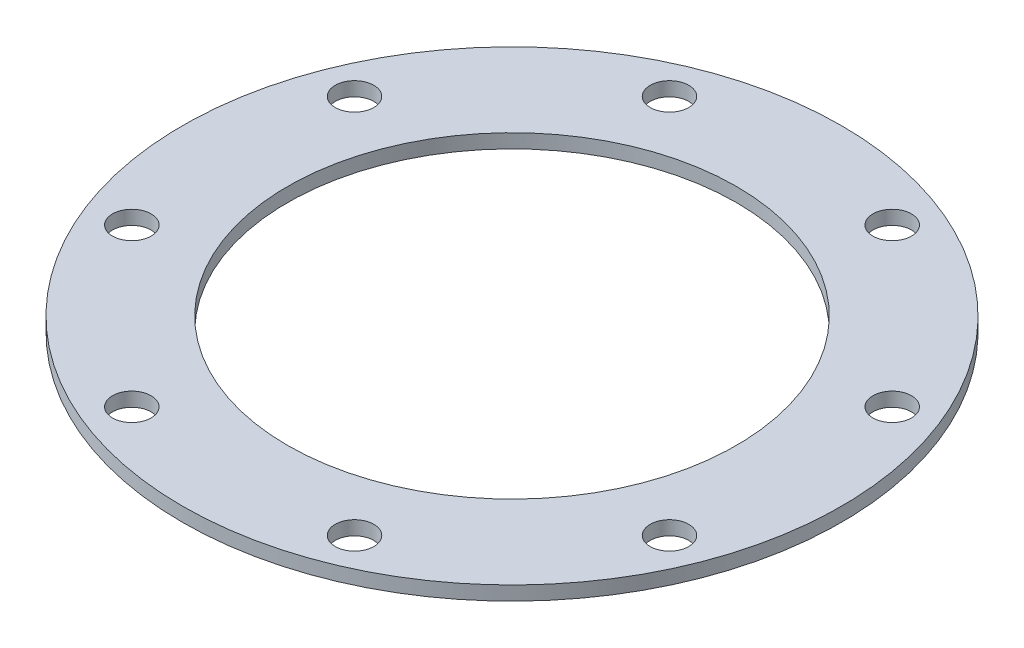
ISO-10303-21;
HEADER;
FILE_DESCRIPTION(('STEP AP214'),'2;1');
FILE_NAME('part.step','',(''),(''),'','','');
FILE_SCHEMA(('AUTOMOTIVE_DESIGN { 1 0 10303 214 1 1 1 1 }'));
ENDSEC;
DATA;
#1=APPLICATION_CONTEXT('core data for automotive mechanical design processes');
#2=APPLICATION_PROTOCOL_DEFINITION('international standard','automotive_design',2000,#1);
#3=PRODUCT_CONTEXT('',#1,'mechanical');
#4=PRODUCT('Part','Part','',(#3));
#5=PRODUCT_RELATED_PRODUCT_CATEGORY('part','',(#4));
#6=PRODUCT_DEFINITION_FORMATION('','',#4);
#7=PRODUCT_DEFINITION_CONTEXT('part definition',#1,'design');
#8=PRODUCT_DEFINITION('design','',#6,#7);
#9=PRODUCT_DEFINITION_SHAPE('','',#8);
#10=(LENGTH_UNIT() NAMED_UNIT(*) SI_UNIT(.MILLI.,.METRE.));
#11=(NAMED_UNIT(*) PLANE_ANGLE_UNIT() SI_UNIT($,.RADIAN.));
#12=(NAMED_UNIT(*) SI_UNIT($,.STERADIAN.) SOLID_ANGLE_UNIT());
#13=UNCERTAINTY_MEASURE_WITH_UNIT(LENGTH_MEASURE(1.E-05),#10,'distance_accuracy_value','');
#14=(GEOMETRIC_REPRESENTATION_CONTEXT(3) GLOBAL_UNCERTAINTY_ASSIGNED_CONTEXT((#13)) GLOBAL_UNIT_ASSIGNED_CONTEXT((#10,
#11,#12)) REPRESENTATION_CONTEXT('',''));
#15=CARTESIAN_POINT('',(0.,0.,0.));
#16=DIRECTION('',(0.,0.,1.));
#17=DIRECTION('',(1.,0.,0.));
#18=AXIS2_PLACEMENT_3D('',#15,#16,#17);
#19=CARTESIAN_POINT('',(0.,6.35,0.));
#20=DIRECTION('',(0.,1.,0.));
#21=DIRECTION('',(0.,0.,1.));
#22=AXIS2_PLACEMENT_3D('',#19,#20,#21);
#23=PLANE('',#22);
#24=CARTESIAN_POINT('',(-50.4233257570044,6.35,-121.732676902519));
#25=DIRECTION('',(0.,1.,0.));
#26=DIRECTION('',(0.707106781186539,0.,0.707106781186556));
#27=AXIS2_PLACEMENT_3D('',#24,#25,#26);
#28=CIRCLE('',#27,8.73124999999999);
#29=CARTESIAN_POINT('',(-44.2493996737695,6.35,-115.558750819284));
#30=VERTEX_POINT('',#29);
#31=EDGE_CURVE('E128',#30,#30,#28,.T.);
#32=ORIENTED_EDGE('',*,*,#31,.F.);
#33=EDGE_LOOP('',(#32));
#34=FACE_BOUND('',#33,.T.);
#35=CARTESIAN_POINT('',(-121.732676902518,6.35,-50.4233257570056));
#36=DIRECTION('',(0.,1.,0.));
#37=DIRECTION('',(1.,0.,0.));
#38=AXIS2_PLACEMENT_3D('',#35,#36,#37);
#39=CIRCLE('',#38,8.73124999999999);
#40=CARTESIAN_POINT('',(-113.001426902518,6.35,-50.4233257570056));
#41=VERTEX_POINT('',#40);
#42=EDGE_CURVE('E130',#41,#41,#39,.T.);
#43=ORIENTED_EDGE('',*,*,#42,.F.);
#44=EDGE_LOOP('',(#43));
#45=FACE_BOUND('',#44,.T.);
#46=CARTESIAN_POINT('',(-121.732676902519,6.35,50.4233257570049));
#47=DIRECTION('',(0.,1.,0.));
#48=DIRECTION('',(0.707106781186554,0.,-0.707106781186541));
#49=AXIS2_PLACEMENT_3D('',#46,#47,#48);
#50=CIRCLE('',#49,8.73124999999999);
#51=CARTESIAN_POINT('',(-115.558750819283,6.35,44.2493996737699));
#52=VERTEX_POINT('',#51);
#53=EDGE_CURVE('E147',#52,#52,#50,.T.);
#54=ORIENTED_EDGE('',*,*,#53,.F.);
#55=EDGE_LOOP('',(#54));
#56=FACE_BOUND('',#55,.T.);
#57=CARTESIAN_POINT('',(-50.4233257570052,6.35,121.732676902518));
#58=DIRECTION('',(0.,1.,0.));
#59=DIRECTION('',(0.,0.,-1.));
#60=AXIS2_PLACEMENT_3D('',#57,#58,#59);
#61=CIRCLE('',#60,8.73124999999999);
#62=CARTESIAN_POINT('',(-50.4233257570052,6.35,113.001426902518));
#63=VERTEX_POINT('',#62);
#64=EDGE_CURVE('E146',#63,#63,#61,.T.);
#65=ORIENTED_EDGE('',*,*,#64,.F.);
#66=EDGE_LOOP('',(#65));
#67=FACE_BOUND('',#66,.T.);
#68=CARTESIAN_POINT('',(50.4233257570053,6.35,121.732676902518));
#69=DIRECTION('',(0.,1.,0.));
#70=DIRECTION('',(-0.707106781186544,0.,-0.707106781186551));
#71=AXIS2_PLACEMENT_3D('',#68,#69,#70);
#72=CIRCLE('',#71,8.73124999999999);
#73=CARTESIAN_POINT('',(44.2493996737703,6.35,115.558750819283));
#74=VERTEX_POINT('',#73);
#75=EDGE_CURVE('E154',#74,#74,#72,.T.);
#76=ORIENTED_EDGE('',*,*,#75,.F.);
#77=EDGE_LOOP('',(#76));
#78=FACE_BOUND('',#77,.T.);
#79=CARTESIAN_POINT('',(121.732676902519,6.35,50.4233257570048));
#80=DIRECTION('',(0.,1.,0.));
#81=DIRECTION('',(-1.,0.,0.));
#82=AXIS2_PLACEMENT_3D('',#79,#80,#81);
#83=CIRCLE('',#82,8.73124999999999);
#84=CARTESIAN_POINT('',(113.001426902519,6.35,50.4233257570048));
#85=VERTEX_POINT('',#84);
#86=EDGE_CURVE('E168',#85,#85,#83,.T.);
#87=ORIENTED_EDGE('',*,*,#86,.F.);
#88=EDGE_LOOP('',(#87));
#89=FACE_BOUND('',#88,.T.);
#90=CARTESIAN_POINT('',(121.732676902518,6.35,-50.4233257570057));
#91=DIRECTION('',(0.,1.,0.));
#92=DIRECTION('',(-0.707106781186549,0.,0.707106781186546));
#93=AXIS2_PLACEMENT_3D('',#90,#91,#92);
#94=CIRCLE('',#93,8.73124999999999);
#95=CARTESIAN_POINT('',(115.558750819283,6.35,-44.2493996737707));
#96=VERTEX_POINT('',#95);
#97=EDGE_CURVE('E167',#96,#96,#94,.T.);
#98=ORIENTED_EDGE('',*,*,#97,.F.);
#99=EDGE_LOOP('',(#98));
#100=FACE_BOUND('',#99,.T.);
#101=CARTESIAN_POINT('',(50.4233257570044,6.35,-121.732676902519));
#102=DIRECTION('',(0.,1.,0.));
#103=DIRECTION('',(0.,0.,1.));
#104=AXIS2_PLACEMENT_3D('',#101,#102,#103);
#105=CIRCLE('',#104,8.73124999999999);
#106=CARTESIAN_POINT('',(50.4233257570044,6.35,-113.001426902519));
#107=VERTEX_POINT('',#106);
#108=EDGE_CURVE('E55',#107,#107,#105,.T.);
#109=ORIENTED_EDGE('',*,*,#108,.F.);
#110=EDGE_LOOP('',(#109));
#111=FACE_BOUND('',#110,.T.);
#112=CARTESIAN_POINT('',(0.,6.35,0.));
#113=DIRECTION('',(0.,1.,0.));
#114=DIRECTION('',(0.,0.,1.));
#115=AXIS2_PLACEMENT_3D('',#112,#113,#114);
#116=CIRCLE('',#115,149.225);
#117=CARTESIAN_POINT('',(0.,6.35,149.225));
#118=VERTEX_POINT('',#117);
#119=EDGE_CURVE('E11',#118,#118,#116,.T.);
#120=ORIENTED_EDGE('',*,*,#119,.T.);
#121=EDGE_LOOP('',(#120));
#122=FACE_BOUND('',#121,.T.);
#123=CARTESIAN_POINT('',(0.,6.35,0.));
#124=DIRECTION('',(0.,1.,0.));
#125=DIRECTION('',(0.,0.,1.));
#126=AXIS2_PLACEMENT_3D('',#123,#124,#125);
#127=CIRCLE('',#126,101.6);
#128=CARTESIAN_POINT('',(0.,6.35,101.6));
#129=VERTEX_POINT('',#128);
#130=EDGE_CURVE('E46',#129,#129,#127,.T.);
#131=ORIENTED_EDGE('',*,*,#130,.F.);
#132=EDGE_LOOP('',(#131));
#133=FACE_BOUND('',#132,.T.);
#134=ADVANCED_FACE('F35',(#34,#45,#56,#67,#78,#89,#100,#111,#122,#133),#23,.T.);
#135=CARTESIAN_POINT('',(0.,0.,0.));
#136=DIRECTION('',(0.,1.,0.));
#137=DIRECTION('',(0.,0.,1.));
#138=AXIS2_PLACEMENT_3D('',#135,#136,#137);
#139=PLANE('',#138);
#140=CARTESIAN_POINT('',(-50.4233257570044,0.,-121.732676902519));
#141=DIRECTION('',(0.,1.,0.));
#142=DIRECTION('',(0.707106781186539,0.,0.707106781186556));
#143=AXIS2_PLACEMENT_3D('',#140,#141,#142);
#144=CIRCLE('',#143,8.73124999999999);
#145=CARTESIAN_POINT('',(-44.2493996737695,0.,-115.558750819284));
#146=VERTEX_POINT('',#145);
#147=EDGE_CURVE('E126',#146,#146,#144,.T.);
#148=ORIENTED_EDGE('',*,*,#147,.T.);
#149=EDGE_LOOP('',(#148));
#150=FACE_BOUND('',#149,.T.);
#151=CARTESIAN_POINT('',(-121.732676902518,0.,-50.4233257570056));
#152=DIRECTION('',(0.,1.,0.));
#153=DIRECTION('',(1.,0.,0.));
#154=AXIS2_PLACEMENT_3D('',#151,#152,#153);
#155=CIRCLE('',#154,8.73124999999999);
#156=CARTESIAN_POINT('',(-113.001426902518,0.,-50.4233257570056));
#157=VERTEX_POINT('',#156);
#158=EDGE_CURVE('E134',#157,#157,#155,.T.);
#159=ORIENTED_EDGE('',*,*,#158,.T.);
#160=EDGE_LOOP('',(#159));
#161=FACE_BOUND('',#160,.T.);
#162=CARTESIAN_POINT('',(-121.732676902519,0.,50.4233257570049));
#163=DIRECTION('',(0.,1.,0.));
#164=DIRECTION('',(0.707106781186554,0.,-0.707106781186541));
#165=AXIS2_PLACEMENT_3D('',#162,#163,#164);
#166=CIRCLE('',#165,8.73124999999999);
#167=CARTESIAN_POINT('',(-115.558750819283,0.,44.2493996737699));
#168=VERTEX_POINT('',#167);
#169=EDGE_CURVE('E144',#168,#168,#166,.T.);
#170=ORIENTED_EDGE('',*,*,#169,.T.);
#171=EDGE_LOOP('',(#170));
#172=FACE_BOUND('',#171,.T.);
#173=CARTESIAN_POINT('',(-50.4233257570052,0.,121.732676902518));
#174=DIRECTION('',(0.,1.,0.));
#175=DIRECTION('',(0.,0.,-1.));
#176=AXIS2_PLACEMENT_3D('',#173,#174,#175);
#177=CIRCLE('',#176,8.73124999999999);
#178=CARTESIAN_POINT('',(-50.4233257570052,0.,113.001426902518));
#179=VERTEX_POINT('',#178);
#180=EDGE_CURVE('E151',#179,#179,#177,.T.);
#181=ORIENTED_EDGE('',*,*,#180,.T.);
#182=EDGE_LOOP('',(#181));
#183=FACE_BOUND('',#182,.T.);
#184=CARTESIAN_POINT('',(50.4233257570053,0.,121.732676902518));
#185=DIRECTION('',(0.,1.,0.));
#186=DIRECTION('',(-0.707106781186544,0.,-0.707106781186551));
#187=AXIS2_PLACEMENT_3D('',#184,#185,#186);
#188=CIRCLE('',#187,8.73124999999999);
#189=CARTESIAN_POINT('',(44.2493996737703,0.,115.558750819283));
#190=VERTEX_POINT('',#189);
#191=EDGE_CURVE('E158',#190,#190,#188,.T.);
#192=ORIENTED_EDGE('',*,*,#191,.T.);
#193=EDGE_LOOP('',(#192));
#194=FACE_BOUND('',#193,.T.);
#195=CARTESIAN_POINT('',(121.732676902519,0.,50.4233257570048));
#196=DIRECTION('',(0.,1.,0.));
#197=DIRECTION('',(-1.,0.,0.));
#198=AXIS2_PLACEMENT_3D('',#195,#196,#197);
#199=CIRCLE('',#198,8.73124999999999);
#200=CARTESIAN_POINT('',(113.001426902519,0.,50.4233257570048));
#201=VERTEX_POINT('',#200);
#202=EDGE_CURVE('E165',#201,#201,#199,.T.);
#203=ORIENTED_EDGE('',*,*,#202,.T.);
#204=EDGE_LOOP('',(#203));
#205=FACE_BOUND('',#204,.T.);
#206=CARTESIAN_POINT('',(121.732676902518,0.,-50.4233257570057));
#207=DIRECTION('',(0.,1.,0.));
#208=DIRECTION('',(-0.707106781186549,0.,0.707106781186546));
#209=AXIS2_PLACEMENT_3D('',#206,#207,#208);
#210=CIRCLE('',#209,8.73124999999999);
#211=CARTESIAN_POINT('',(115.558750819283,0.,-44.2493996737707));
#212=VERTEX_POINT('',#211);
#213=EDGE_CURVE('E60',#212,#212,#210,.T.);
#214=ORIENTED_EDGE('',*,*,#213,.T.);
#215=EDGE_LOOP('',(#214));
#216=FACE_BOUND('',#215,.T.);
#217=CARTESIAN_POINT('',(50.4233257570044,0.,-121.732676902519));
#218=DIRECTION('',(0.,1.,0.));
#219=DIRECTION('',(0.,0.,1.));
#220=AXIS2_PLACEMENT_3D('',#217,#218,#219);
#221=CIRCLE('',#220,8.73124999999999);
#222=CARTESIAN_POINT('',(50.4233257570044,0.,-113.001426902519));
#223=VERTEX_POINT('',#222);
#224=EDGE_CURVE('E59',#223,#223,#221,.T.);
#225=ORIENTED_EDGE('',*,*,#224,.T.);
#226=EDGE_LOOP('',(#225));
#227=FACE_BOUND('',#226,.T.);
#228=CARTESIAN_POINT('',(0.,0.,0.));
#229=DIRECTION('',(0.,1.,0.));
#230=DIRECTION('',(0.,0.,1.));
#231=AXIS2_PLACEMENT_3D('',#228,#229,#230);
#232=CIRCLE('',#231,149.225);
#233=CARTESIAN_POINT('',(0.,0.,149.225));
#234=VERTEX_POINT('',#233);
#235=EDGE_CURVE('E39',#234,#234,#232,.T.);
#236=ORIENTED_EDGE('',*,*,#235,.F.);
#237=EDGE_LOOP('',(#236));
#238=FACE_BOUND('',#237,.T.);
#239=CARTESIAN_POINT('',(0.,0.,0.));
#240=DIRECTION('',(0.,1.,0.));
#241=DIRECTION('',(0.,0.,1.));
#242=AXIS2_PLACEMENT_3D('',#239,#240,#241);
#243=CIRCLE('',#242,101.6);
#244=CARTESIAN_POINT('',(0.,0.,101.6));
#245=VERTEX_POINT('',#244);
#246=EDGE_CURVE('E49',#245,#245,#243,.T.);
#247=ORIENTED_EDGE('',*,*,#246,.T.);
#248=EDGE_LOOP('',(#247));
#249=FACE_BOUND('',#248,.T.);
#250=ADVANCED_FACE('F71',(#150,#161,#172,#183,#194,#205,#216,#227,#238,#249),#139,.F.);
#251=CARTESIAN_POINT('',(0.,6.35,0.));
#252=DIRECTION('',(0.,-1.,0.));
#253=DIRECTION('',(0.,0.,-1.));
#254=AXIS2_PLACEMENT_3D('',#251,#252,#253);
#255=CYLINDRICAL_SURFACE('',#254,149.225);
#256=ORIENTED_EDGE('',*,*,#119,.F.);
#257=EDGE_LOOP('',(#256));
#258=FACE_BOUND('',#257,.T.);
#259=ORIENTED_EDGE('',*,*,#235,.T.);
#260=EDGE_LOOP('',(#259));
#261=FACE_BOUND('',#260,.T.);
#262=ADVANCED_FACE('F37',(#258,#261),#255,.T.);
#263=CARTESIAN_POINT('',(0.,6.35,0.));
#264=DIRECTION('',(0.,-1.,0.));
#265=DIRECTION('',(0.,0.,-1.));
#266=AXIS2_PLACEMENT_3D('',#263,#264,#265);
#267=CYLINDRICAL_SURFACE('',#266,101.6);
#268=ORIENTED_EDGE('',*,*,#130,.T.);
#269=EDGE_LOOP('',(#268));
#270=FACE_BOUND('',#269,.T.);
#271=ORIENTED_EDGE('',*,*,#246,.F.);
#272=EDGE_LOOP('',(#271));
#273=FACE_BOUND('',#272,.T.);
#274=ADVANCED_FACE('F78',(#270,#273),#267,.F.);
#275=CARTESIAN_POINT('',(50.4233257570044,0.,-121.732676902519));
#276=DIRECTION('',(0.,1.,0.));
#277=DIRECTION('',(0.,0.,1.));
#278=AXIS2_PLACEMENT_3D('',#275,#276,#277);
#279=CYLINDRICAL_SURFACE('',#278,8.73124999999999);
#280=ORIENTED_EDGE('',*,*,#224,.F.);
#281=EDGE_LOOP('',(#280));
#282=FACE_BOUND('',#281,.T.);
#283=ORIENTED_EDGE('',*,*,#108,.T.);
#284=EDGE_LOOP('',(#283));
#285=FACE_BOUND('',#284,.T.);
#286=ADVANCED_FACE('F74',(#282,#285),#279,.F.);
#287=CARTESIAN_POINT('',(121.732676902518,0.,-50.4233257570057));
#288=DIRECTION('',(0.,1.,0.));
#289=DIRECTION('',(0.,0.,1.));
#290=AXIS2_PLACEMENT_3D('',#287,#288,#289);
#291=CYLINDRICAL_SURFACE('',#290,8.73124999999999);
#292=ORIENTED_EDGE('',*,*,#213,.F.);
#293=EDGE_LOOP('',(#292));
#294=FACE_BOUND('',#293,.T.);
#295=ORIENTED_EDGE('',*,*,#97,.T.);
#296=EDGE_LOOP('',(#295));
#297=FACE_BOUND('',#296,.T.);
#298=ADVANCED_FACE('F77',(#294,#297),#291,.F.);
#299=CARTESIAN_POINT('',(121.732676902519,0.,50.4233257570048));
#300=DIRECTION('',(0.,1.,0.));
#301=DIRECTION('',(0.,0.,1.));
#302=AXIS2_PLACEMENT_3D('',#299,#300,#301);
#303=CYLINDRICAL_SURFACE('',#302,8.73124999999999);
#304=ORIENTED_EDGE('',*,*,#202,.F.);
#305=EDGE_LOOP('',(#304));
#306=FACE_BOUND('',#305,.T.);
#307=ORIENTED_EDGE('',*,*,#86,.T.);
#308=EDGE_LOOP('',(#307));
#309=FACE_BOUND('',#308,.T.);
#310=ADVANCED_FACE('F97',(#306,#309),#303,.F.);
#311=CARTESIAN_POINT('',(50.4233257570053,0.,121.732676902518));
#312=DIRECTION('',(0.,1.,0.));
#313=DIRECTION('',(0.,0.,1.));
#314=AXIS2_PLACEMENT_3D('',#311,#312,#313);
#315=CYLINDRICAL_SURFACE('',#314,8.73124999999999);
#316=ORIENTED_EDGE('',*,*,#191,.F.);
#317=EDGE_LOOP('',(#316));
#318=FACE_BOUND('',#317,.T.);
#319=ORIENTED_EDGE('',*,*,#75,.T.);
#320=EDGE_LOOP('',(#319));
#321=FACE_BOUND('',#320,.T.);
#322=ADVANCED_FACE('F101',(#318,#321),#315,.F.);
#323=CARTESIAN_POINT('',(-50.4233257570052,0.,121.732676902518));
#324=DIRECTION('',(0.,1.,0.));
#325=DIRECTION('',(0.,0.,1.));
#326=AXIS2_PLACEMENT_3D('',#323,#324,#325);
#327=CYLINDRICAL_SURFACE('',#326,8.73124999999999);
#328=ORIENTED_EDGE('',*,*,#180,.F.);
#329=EDGE_LOOP('',(#328));
#330=FACE_BOUND('',#329,.T.);
#331=ORIENTED_EDGE('',*,*,#64,.T.);
#332=EDGE_LOOP('',(#331));
#333=FACE_BOUND('',#332,.T.);
#334=ADVANCED_FACE('F105',(#330,#333),#327,.F.);
#335=CARTESIAN_POINT('',(-121.732676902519,0.,50.4233257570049));
#336=DIRECTION('',(0.,1.,0.));
#337=DIRECTION('',(0.,0.,1.));
#338=AXIS2_PLACEMENT_3D('',#335,#336,#337);
#339=CYLINDRICAL_SURFACE('',#338,8.73124999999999);
#340=ORIENTED_EDGE('',*,*,#169,.F.);
#341=EDGE_LOOP('',(#340));
#342=FACE_BOUND('',#341,.T.);
#343=ORIENTED_EDGE('',*,*,#53,.T.);
#344=EDGE_LOOP('',(#343));
#345=FACE_BOUND('',#344,.T.);
#346=ADVANCED_FACE('F109',(#342,#345),#339,.F.);
#347=CARTESIAN_POINT('',(-121.732676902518,0.,-50.4233257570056));
#348=DIRECTION('',(0.,1.,0.));
#349=DIRECTION('',(0.,0.,1.));
#350=AXIS2_PLACEMENT_3D('',#347,#348,#349);
#351=CYLINDRICAL_SURFACE('',#350,8.73124999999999);
#352=ORIENTED_EDGE('',*,*,#158,.F.);
#353=EDGE_LOOP('',(#352));
#354=FACE_BOUND('',#353,.T.);
#355=ORIENTED_EDGE('',*,*,#42,.T.);
#356=EDGE_LOOP('',(#355));
#357=FACE_BOUND('',#356,.T.);
#358=ADVANCED_FACE('F113',(#354,#357),#351,.F.);
#359=CARTESIAN_POINT('',(-50.4233257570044,0.,-121.732676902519));
#360=DIRECTION('',(0.,1.,0.));
#361=DIRECTION('',(0.,0.,1.));
#362=AXIS2_PLACEMENT_3D('',#359,#360,#361);
#363=CYLINDRICAL_SURFACE('',#362,8.73124999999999);
#364=ORIENTED_EDGE('',*,*,#147,.F.);
#365=EDGE_LOOP('',(#364));
#366=FACE_BOUND('',#365,.T.);
#367=ORIENTED_EDGE('',*,*,#31,.T.);
#368=EDGE_LOOP('',(#367));
#369=FACE_BOUND('',#368,.T.);
#370=ADVANCED_FACE('F117',(#366,#369),#363,.F.);
#371=CLOSED_SHELL('',(#134,#250,#262,#274,#286,#298,#310,#322,#334,#346,#358,#370));
#372=MANIFOLD_SOLID_BREP('B2',#371);
#373=ADVANCED_BREP_SHAPE_REPRESENTATION('',(#18,#372),#14);
#374=SHAPE_DEFINITION_REPRESENTATION(#9,#373);
ENDSEC;
END-ISO-10303-21;
